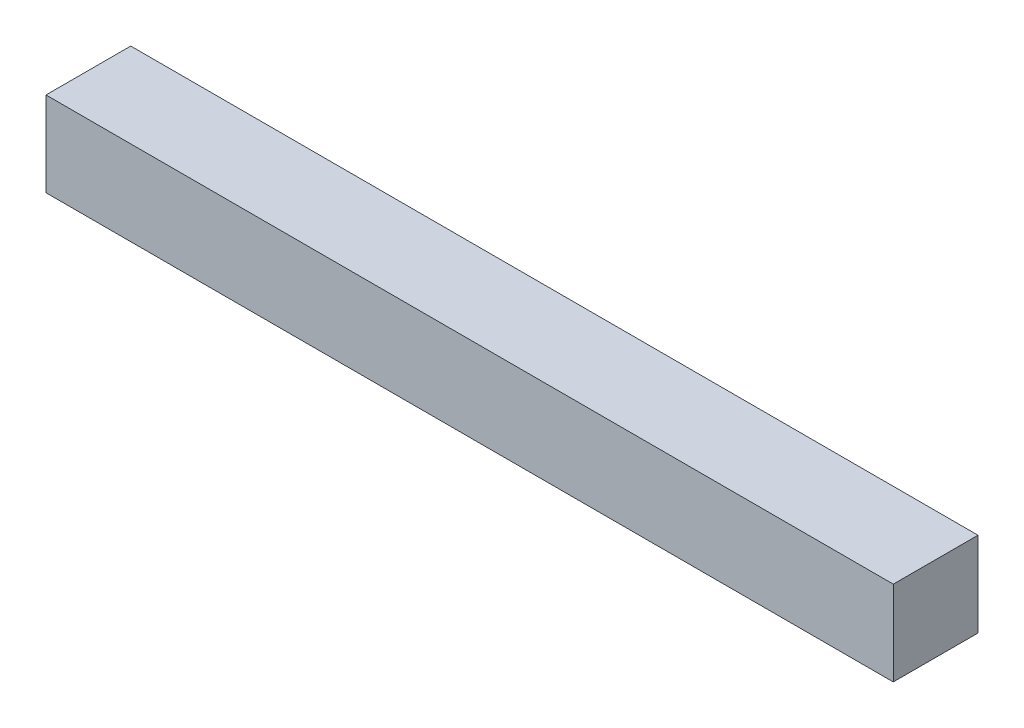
from build123d import *

# Parameters (mm, degrees)
SKETCH1_W           = 100
SKETCH1_H           = 10
BOSS_EXTRUDE1_DEPTH = 10


with BuildPart() as part:
    # Sketch1 → Boss-Extrude1 (new body)
    with BuildSketch(Plane(origin=(0, 0, 0), x_dir=(1, 0, 0), z_dir=(0, 1, 0))):
        with Locations((50, 5)):
            Rectangle(SKETCH1_W, SKETCH1_H)
    extrude(amount=BOSS_EXTRUDE1_DEPTH)


solid = part.part
